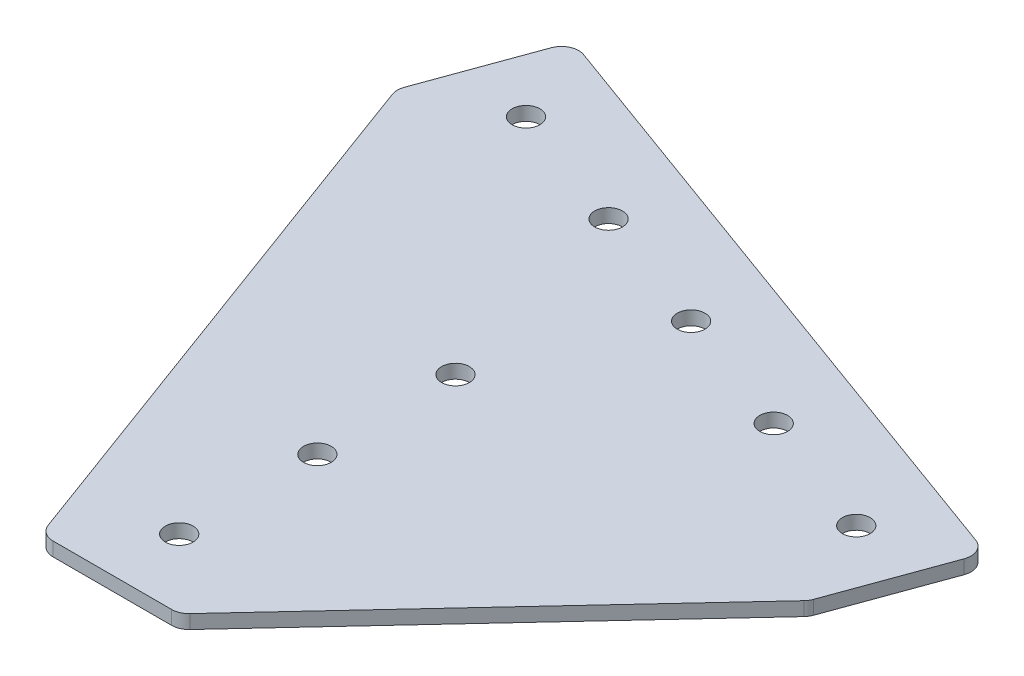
ISO-10303-21;
HEADER;
FILE_DESCRIPTION(('STEP AP214'),'2;1');
FILE_NAME('part.step','',(''),(''),'','','');
FILE_SCHEMA(('AUTOMOTIVE_DESIGN { 1 0 10303 214 1 1 1 1 }'));
ENDSEC;
DATA;
#1=APPLICATION_CONTEXT('core data for automotive mechanical design processes');
#2=APPLICATION_PROTOCOL_DEFINITION('international standard','automotive_design',2000,#1);
#3=PRODUCT_CONTEXT('',#1,'mechanical');
#4=PRODUCT('Part','Part','',(#3));
#5=PRODUCT_RELATED_PRODUCT_CATEGORY('part','',(#4));
#6=PRODUCT_DEFINITION_FORMATION('','',#4);
#7=PRODUCT_DEFINITION_CONTEXT('part definition',#1,'design');
#8=PRODUCT_DEFINITION('design','',#6,#7);
#9=PRODUCT_DEFINITION_SHAPE('','',#8);
#10=(LENGTH_UNIT() NAMED_UNIT(*) SI_UNIT(.MILLI.,.METRE.));
#11=(NAMED_UNIT(*) PLANE_ANGLE_UNIT() SI_UNIT($,.RADIAN.));
#12=(NAMED_UNIT(*) SI_UNIT($,.STERADIAN.) SOLID_ANGLE_UNIT());
#13=UNCERTAINTY_MEASURE_WITH_UNIT(LENGTH_MEASURE(1.E-05),#10,'distance_accuracy_value','');
#14=(GEOMETRIC_REPRESENTATION_CONTEXT(3) GLOBAL_UNCERTAINTY_ASSIGNED_CONTEXT((#13)) GLOBAL_UNIT_ASSIGNED_CONTEXT((#10,
#11,#12)) REPRESENTATION_CONTEXT('',''));
#15=CARTESIAN_POINT('',(0.,0.,0.));
#16=DIRECTION('',(0.,0.,1.));
#17=DIRECTION('',(1.,0.,0.));
#18=AXIS2_PLACEMENT_3D('',#15,#16,#17);
#19=CARTESIAN_POINT('',(25.4,2.54,0.));
#20=DIRECTION('',(0.,0.,-1.));
#21=DIRECTION('',(-1.,0.,0.));
#22=AXIS2_PLACEMENT_3D('',#19,#20,#21);
#23=PLANE('',#22);
#24=DIRECTION('',(1.,0.,0.));
#25=VECTOR('',#24,1.);
#26=CARTESIAN_POINT('',(25.4,2.54,0.));
#27=LINE('',#26,#25);
#28=CARTESIAN_POINT('',(2.21311904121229,2.54,0.));
#29=VERTEX_POINT('',#28);
#30=CARTESIAN_POINT('',(24.0165025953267,2.54,0.));
#31=VERTEX_POINT('',#30);
#32=EDGE_CURVE('E158',#29,#31,#27,.T.);
#33=ORIENTED_EDGE('',*,*,#32,.F.);
#34=DIRECTION('',(0.,-1.,0.));
#35=VECTOR('',#34,1.);
#36=CARTESIAN_POINT('',(2.21311904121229,2.54,0.));
#37=LINE('',#36,#35);
#38=CARTESIAN_POINT('',(2.21311904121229,0.,0.));
#39=VERTEX_POINT('',#38);
#40=EDGE_CURVE('E216',#29,#39,#37,.T.);
#41=ORIENTED_EDGE('',*,*,#40,.T.);
#42=DIRECTION('',(1.,0.,0.));
#43=VECTOR('',#42,1.);
#44=CARTESIAN_POINT('',(25.4,0.,0.));
#45=LINE('',#44,#43);
#46=CARTESIAN_POINT('',(24.0165025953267,0.,0.));
#47=VERTEX_POINT('',#46);
#48=EDGE_CURVE('E257',#39,#47,#45,.T.);
#49=ORIENTED_EDGE('',*,*,#48,.T.);
#50=DIRECTION('',(0.,-1.,0.));
#51=VECTOR('',#50,1.);
#52=CARTESIAN_POINT('',(24.0165025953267,2.54,0.));
#53=LINE('',#52,#51);
#54=EDGE_CURVE('E213',#47,#31,#53,.F.);
#55=ORIENTED_EDGE('',*,*,#54,.T.);
#56=EDGE_LOOP('',(#33,#41,#49,#55));
#57=FACE_BOUND('',#56,.T.);
#58=ADVANCED_FACE('F36',(#57),#23,.F.);
#59=CARTESIAN_POINT('',(81.1889283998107,2.54,-60.0151561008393));
#60=DIRECTION('',(-0.732424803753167,0.,-0.680847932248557));
#61=DIRECTION('',(-0.680847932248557,0.,0.732424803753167));
#62=AXIS2_PLACEMENT_3D('',#59,#60,#61);
#63=PLANE('',#62);
#64=DIRECTION('',(0.680847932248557,0.,-0.732424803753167));
#65=VECTOR('',#64,1.);
#66=CARTESIAN_POINT('',(81.1889283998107,2.54,-60.0151561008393));
#67=LINE('',#66,#65);
#68=CARTESIAN_POINT('',(26.341951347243,2.54,-1.01330781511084));
#69=VERTEX_POINT('',#68);
#70=CARTESIAN_POINT('',(80.7508961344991,2.54,-59.5439411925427));
#71=VERTEX_POINT('',#70);
#72=EDGE_CURVE('E165',#69,#71,#67,.T.);
#73=ORIENTED_EDGE('',*,*,#72,.F.);
#74=DIRECTION('',(0.,-1.,0.));
#75=VECTOR('',#74,1.);
#76=CARTESIAN_POINT('',(26.3419513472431,2.54,-1.01330781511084));
#77=LINE('',#76,#75);
#78=CARTESIAN_POINT('',(26.341951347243,0.,-1.01330781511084));
#79=VERTEX_POINT('',#78);
#80=EDGE_CURVE('E223',#69,#79,#77,.T.);
#81=ORIENTED_EDGE('',*,*,#80,.T.);
#82=DIRECTION('',(0.680847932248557,0.,-0.732424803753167));
#83=VECTOR('',#82,1.);
#84=CARTESIAN_POINT('',(81.1889283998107,0.,-60.0151561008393));
#85=LINE('',#84,#83);
#86=CARTESIAN_POINT('',(80.7508961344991,0.,-59.5439411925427));
#87=VERTEX_POINT('',#86);
#88=EDGE_CURVE('E251',#79,#87,#85,.T.);
#89=ORIENTED_EDGE('',*,*,#88,.T.);
#90=DIRECTION('',(0.,-1.,0.));
#91=VECTOR('',#90,1.);
#92=CARTESIAN_POINT('',(80.7508961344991,2.54,-59.5439411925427));
#93=LINE('',#92,#91);
#94=EDGE_CURVE('E220',#87,#71,#93,.F.);
#95=ORIENTED_EDGE('',*,*,#94,.T.);
#96=EDGE_LOOP('',(#73,#81,#89,#95));
#97=FACE_BOUND('',#96,.T.);
#98=ADVANCED_FACE('F369',(#97),#63,.F.);
#99=CARTESIAN_POINT('',(89.8762400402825,2.54,-83.8833486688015));
#100=DIRECTION('',(-0.939692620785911,0.,-0.342020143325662));
#101=DIRECTION('',(-0.342020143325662,0.,0.939692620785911));
#102=AXIS2_PLACEMENT_3D('',#99,#100,#101);
#103=PLANE('',#102);
#104=DIRECTION('',(0.342020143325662,0.,-0.939692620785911));
#105=VECTOR('',#104,1.);
#106=CARTESIAN_POINT('',(89.8762400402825,2.54,-83.8833486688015));
#107=LINE('',#106,#105);
#108=CARTESIAN_POINT('',(81.408971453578,2.54,-60.6197194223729));
#109=VERTEX_POINT('',#108);
#110=CARTESIAN_POINT('',(88.7903260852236,2.54,-80.8998245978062));
#111=VERTEX_POINT('',#110);
#112=EDGE_CURVE('E233',#109,#111,#107,.T.);
#113=ORIENTED_EDGE('',*,*,#112,.F.);
#114=DIRECTION('',(0.,-1.,0.));
#115=VECTOR('',#114,1.);
#116=CARTESIAN_POINT('',(81.408971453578,2.54,-60.6197194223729));
#117=LINE('',#116,#115);
#118=CARTESIAN_POINT('',(81.408971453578,0.,-60.6197194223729));
#119=VERTEX_POINT('',#118);
#120=EDGE_CURVE('E11',#109,#119,#117,.T.);
#121=ORIENTED_EDGE('',*,*,#120,.T.);
#122=DIRECTION('',(0.342020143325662,0.,-0.939692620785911));
#123=VECTOR('',#122,1.);
#124=CARTESIAN_POINT('',(89.8762400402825,0.,-83.8833486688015));
#125=LINE('',#124,#123);
#126=CARTESIAN_POINT('',(88.7903260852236,0.,-80.8998245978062));
#127=VERTEX_POINT('',#126);
#128=EDGE_CURVE('E236',#119,#127,#125,.T.);
#129=ORIENTED_EDGE('',*,*,#128,.T.);
#130=DIRECTION('',(0.,-1.,0.));
#131=VECTOR('',#130,1.);
#132=CARTESIAN_POINT('',(88.7903260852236,2.54,-80.8998245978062));
#133=LINE('',#132,#131);
#134=EDGE_CURVE('E45',#127,#111,#133,.F.);
#135=ORIENTED_EDGE('',*,*,#134,.T.);
#136=EDGE_LOOP('',(#113,#121,#129,#135));
#137=FACE_BOUND('',#136,.T.);
#138=ADVANCED_FACE('F232',(#137),#103,.F.);
#139=CARTESIAN_POINT('',(-29.4647227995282,2.54,-127.319906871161));
#140=DIRECTION('',(-0.342020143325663,0.,0.939692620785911));
#141=DIRECTION('',(0.939692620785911,0.,0.342020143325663));
#142=AXIS2_PLACEMENT_3D('',#139,#140,#141);
#143=PLANE('',#142);
#144=DIRECTION('',(-0.93969262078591,0.,-0.342020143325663));
#145=VECTOR('',#144,1.);
#146=CARTESIAN_POINT('',(-29.4647227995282,0.,-127.319906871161));
#147=LINE('',#146,#145);
#148=CARTESIAN_POINT('',(86.8927159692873,0.,-84.9692626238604));
#149=VERTEX_POINT('',#148);
#150=CARTESIAN_POINT('',(-26.4811987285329,0.,-126.233992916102));
#151=VERTEX_POINT('',#150);
#152=EDGE_CURVE('E167',#149,#151,#147,.T.);
#153=ORIENTED_EDGE('',*,*,#152,.T.);
#154=DIRECTION('',(0.,-1.,0.));
#155=VECTOR('',#154,1.);
#156=CARTESIAN_POINT('',(-26.4811987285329,2.54,-126.233992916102));
#157=LINE('',#156,#155);
#158=CARTESIAN_POINT('',(-26.4811987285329,2.54,-126.233992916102));
#159=VERTEX_POINT('',#158);
#160=EDGE_CURVE('E52',#151,#159,#157,.F.);
#161=ORIENTED_EDGE('',*,*,#160,.T.);
#162=DIRECTION('',(-0.93969262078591,0.,-0.342020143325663));
#163=VECTOR('',#162,1.);
#164=CARTESIAN_POINT('',(-29.4647227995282,2.54,-127.319906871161));
#165=LINE('',#164,#163);
#166=CARTESIAN_POINT('',(86.8927159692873,2.54,-84.9692626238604));
#167=VERTEX_POINT('',#166);
#168=EDGE_CURVE('E243',#167,#159,#165,.T.);
#169=ORIENTED_EDGE('',*,*,#168,.F.);
#170=DIRECTION('',(0.,-1.,0.));
#171=VECTOR('',#170,1.);
#172=CARTESIAN_POINT('',(86.8927159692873,2.54,-84.9692626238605));
#173=LINE('',#172,#171);
#174=EDGE_CURVE('E207',#167,#149,#173,.T.);
#175=ORIENTED_EDGE('',*,*,#174,.T.);
#176=EDGE_LOOP('',(#153,#161,#169,#175));
#177=FACE_BOUND('',#176,.T.);
#178=ADVANCED_FACE('F247',(#177),#143,.F.);
#179=CARTESIAN_POINT('',(-38.15203444,2.54,-103.451714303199));
#180=DIRECTION('',(0.939692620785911,0.,0.342020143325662));
#181=DIRECTION('',(0.342020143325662,0.,-0.939692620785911));
#182=AXIS2_PLACEMENT_3D('',#179,#180,#181);
#183=PLANE('',#182);
#184=DIRECTION('',(-0.342020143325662,0.,0.939692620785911));
#185=VECTOR('',#184,1.);
#186=CARTESIAN_POINT('',(-38.15203444,0.,-103.451714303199));
#187=LINE('',#186,#185);
#188=CARTESIAN_POINT('',(-30.5506367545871,0.,-124.336382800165));
#189=VERTEX_POINT('',#188);
#190=CARTESIAN_POINT('',(-37.7541787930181,0.,-104.544813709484));
#191=VERTEX_POINT('',#190);
#192=EDGE_CURVE('E159',#189,#191,#187,.T.);
#193=ORIENTED_EDGE('',*,*,#192,.T.);
#194=DIRECTION('',(0.,-1.,0.));
#195=VECTOR('',#194,1.);
#196=CARTESIAN_POINT('',(-37.7541787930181,2.54,-104.544813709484));
#197=LINE('',#196,#195);
#198=CARTESIAN_POINT('',(-37.7541787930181,2.54,-104.544813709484));
#199=VERTEX_POINT('',#198);
#200=EDGE_CURVE('E133',#191,#199,#197,.F.);
#201=ORIENTED_EDGE('',*,*,#200,.T.);
#202=DIRECTION('',(-0.342020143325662,0.,0.939692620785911));
#203=VECTOR('',#202,1.);
#204=CARTESIAN_POINT('',(-38.15203444,2.54,-103.451714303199));
#205=LINE('',#204,#203);
#206=CARTESIAN_POINT('',(-30.5506367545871,2.54,-124.336382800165));
#207=VERTEX_POINT('',#206);
#208=EDGE_CURVE('E264',#207,#199,#205,.T.);
#209=ORIENTED_EDGE('',*,*,#208,.F.);
#210=DIRECTION('',(0.,-1.,0.));
#211=VECTOR('',#210,1.);
#212=CARTESIAN_POINT('',(-30.5506367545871,2.54,-124.336382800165));
#213=LINE('',#212,#211);
#214=EDGE_CURVE('E139',#207,#189,#213,.T.);
#215=ORIENTED_EDGE('',*,*,#214,.T.);
#216=EDGE_LOOP('',(#193,#201,#209,#215));
#217=FACE_BOUND('',#216,.T.);
#218=ADVANCED_FACE('F411',(#217),#183,.F.);
#219=CARTESIAN_POINT('',(0.,2.54,0.));
#220=DIRECTION('',(0.938230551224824,0.,-0.34601074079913));
#221=DIRECTION('',(-0.34601074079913,0.,-0.938230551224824));
#222=AXIS2_PLACEMENT_3D('',#219,#220,#221);
#223=PLANE('',#222);
#224=DIRECTION('',(0.34601074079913,0.,0.938230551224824));
#225=VECTOR('',#224,1.);
#226=CARTESIAN_POINT('',(0.,2.54,0.));
#227=LINE('',#226,#225);
#228=CARTESIAN_POINT('',(-37.7495367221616,2.54,-102.360315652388));
#229=VERTEX_POINT('',#228);
#230=CARTESIAN_POINT('',(-0.765762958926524,2.54,-2.07641589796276));
#231=VERTEX_POINT('',#230);
#232=EDGE_CURVE('E149',#229,#231,#227,.T.);
#233=ORIENTED_EDGE('',*,*,#232,.F.);
#234=DIRECTION('',(0.,-1.,0.));
#235=VECTOR('',#234,1.);
#236=CARTESIAN_POINT('',(-37.7495367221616,2.54,-102.360315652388));
#237=LINE('',#236,#235);
#238=CARTESIAN_POINT('',(-37.7495367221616,0.,-102.360315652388));
#239=VERTEX_POINT('',#238);
#240=EDGE_CURVE('E132',#229,#239,#237,.T.);
#241=ORIENTED_EDGE('',*,*,#240,.T.);
#242=DIRECTION('',(0.34601074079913,0.,0.938230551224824));
#243=VECTOR('',#242,1.);
#244=CARTESIAN_POINT('',(0.,0.,0.));
#245=LINE('',#244,#243);
#246=CARTESIAN_POINT('',(-0.765762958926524,0.,-2.07641589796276));
#247=VERTEX_POINT('',#246);
#248=EDGE_CURVE('E146',#239,#247,#245,.T.);
#249=ORIENTED_EDGE('',*,*,#248,.T.);
#250=DIRECTION('',(0.,-1.,0.));
#251=VECTOR('',#250,1.);
#252=CARTESIAN_POINT('',(-0.765762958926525,2.54,-2.07641589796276));
#253=LINE('',#252,#251);
#254=EDGE_CURVE('E152',#247,#231,#253,.F.);
#255=ORIENTED_EDGE('',*,*,#254,.T.);
#256=EDGE_LOOP('',(#233,#241,#249,#255));
#257=FACE_BOUND('',#256,.T.);
#258=ADVANCED_FACE('F145',(#257),#223,.F.);
#259=CARTESIAN_POINT('',(0.,2.54,0.));
#260=DIRECTION('',(0.,-1.,0.));
#261=DIRECTION('',(0.,0.,-1.));
#262=AXIS2_PLACEMENT_3D('',#259,#260,#261);
#263=PLANE('',#262);
#264=CARTESIAN_POINT('',(73.5984879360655,2.54,-76.2929082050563));
#265=DIRECTION('',(0.,-1.,0.));
#266=DIRECTION('',(0.,0.,-1.));
#267=AXIS2_PLACEMENT_3D('',#264,#265,#266);
#268=CIRCLE('',#267,2.55270000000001);
#269=CARTESIAN_POINT('',(73.5984879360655,2.54,-78.8456082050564));
#270=VERTEX_POINT('',#269);
#271=EDGE_CURVE('E326',#270,#270,#268,.T.);
#272=ORIENTED_EDGE('',*,*,#271,.T.);
#273=EDGE_LOOP('',(#272));
#274=FACE_BOUND('',#273,.T.);
#275=CARTESIAN_POINT('',(49.7302953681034,2.54,-84.9802198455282));
#276=DIRECTION('',(0.,-1.,0.));
#277=DIRECTION('',(0.,0.,-1.));
#278=AXIS2_PLACEMENT_3D('',#275,#276,#277);
#279=CIRCLE('',#278,2.5527);
#280=CARTESIAN_POINT('',(49.7302953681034,2.54,-87.5329198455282));
#281=VERTEX_POINT('',#280);
#282=EDGE_CURVE('E318',#281,#281,#279,.T.);
#283=ORIENTED_EDGE('',*,*,#282,.T.);
#284=EDGE_LOOP('',(#283));
#285=FACE_BOUND('',#284,.T.);
#286=CARTESIAN_POINT('',(25.8621028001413,2.54,-93.667531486));
#287=DIRECTION('',(0.,-1.,0.));
#288=DIRECTION('',(0.,0.,-1.));
#289=AXIS2_PLACEMENT_3D('',#286,#287,#288);
#290=CIRCLE('',#289,2.5527);
#291=CARTESIAN_POINT('',(25.8621028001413,2.54,-96.220231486));
#292=VERTEX_POINT('',#291);
#293=EDGE_CURVE('E310',#292,#292,#290,.T.);
#294=ORIENTED_EDGE('',*,*,#293,.T.);
#295=EDGE_LOOP('',(#294));
#296=FACE_BOUND('',#295,.T.);
#297=CARTESIAN_POINT('',(1.99391023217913,2.54,-102.354843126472));
#298=DIRECTION('',(0.,-1.,0.));
#299=DIRECTION('',(0.,0.,-1.));
#300=AXIS2_PLACEMENT_3D('',#297,#298,#299);
#301=CIRCLE('',#300,2.5527);
#302=CARTESIAN_POINT('',(1.99391023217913,2.54,-104.907543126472));
#303=VERTEX_POINT('',#302);
#304=EDGE_CURVE('E302',#303,#303,#301,.T.);
#305=ORIENTED_EDGE('',*,*,#304,.T.);
#306=EDGE_LOOP('',(#305));
#307=FACE_BOUND('',#306,.T.);
#308=CARTESIAN_POINT('',(-21.874282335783,2.54,-111.042154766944));
#309=DIRECTION('',(0.,-1.,0.));
#310=DIRECTION('',(0.,0.,-1.));
#311=AXIS2_PLACEMENT_3D('',#308,#309,#310);
#312=CIRCLE('',#311,2.5527);
#313=CARTESIAN_POINT('',(-21.874282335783,2.54,-113.594854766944));
#314=VERTEX_POINT('',#313);
#315=EDGE_CURVE('E294',#314,#314,#312,.T.);
#316=ORIENTED_EDGE('',*,*,#315,.T.);
#317=EDGE_LOOP('',(#316));
#318=FACE_BOUND('',#317,.T.);
#319=CARTESIAN_POINT('',(12.7,2.54,-63.5));
#320=DIRECTION('',(0.,-1.,0.));
#321=DIRECTION('',(0.,0.,-1.));
#322=AXIS2_PLACEMENT_3D('',#319,#320,#321);
#323=CIRCLE('',#322,2.5527);
#324=CARTESIAN_POINT('',(12.7,2.54,-66.0527));
#325=VERTEX_POINT('',#324);
#326=EDGE_CURVE('E286',#325,#325,#323,.T.);
#327=ORIENTED_EDGE('',*,*,#326,.T.);
#328=EDGE_LOOP('',(#327));
#329=FACE_BOUND('',#328,.T.);
#330=CARTESIAN_POINT('',(12.7,2.54,-38.1));
#331=DIRECTION('',(0.,-1.,0.));
#332=DIRECTION('',(0.,0.,-1.));
#333=AXIS2_PLACEMENT_3D('',#330,#331,#332);
#334=CIRCLE('',#333,2.5527);
#335=CARTESIAN_POINT('',(12.7,2.54,-40.6527));
#336=VERTEX_POINT('',#335);
#337=EDGE_CURVE('E278',#336,#336,#334,.T.);
#338=ORIENTED_EDGE('',*,*,#337,.T.);
#339=EDGE_LOOP('',(#338));
#340=FACE_BOUND('',#339,.T.);
#341=CARTESIAN_POINT('',(12.7,2.54,-12.7));
#342=DIRECTION('',(0.,-1.,0.));
#343=DIRECTION('',(0.,0.,-1.));
#344=AXIS2_PLACEMENT_3D('',#341,#342,#343);
#345=CIRCLE('',#344,2.5527);
#346=CARTESIAN_POINT('',(12.7,2.54,-15.2527));
#347=VERTEX_POINT('',#346);
#348=EDGE_CURVE('E261',#347,#347,#345,.T.);
#349=ORIENTED_EDGE('',*,*,#348,.T.);
#350=EDGE_LOOP('',(#349));
#351=FACE_BOUND('',#350,.T.);
#352=ORIENTED_EDGE('',*,*,#208,.T.);
#353=CARTESIAN_POINT('',(-34.7706547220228,2.54,-103.458899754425));
#354=DIRECTION('',(0.,-1.,0.));
#355=DIRECTION('',(0.,0.,-1.));
#356=AXIS2_PLACEMENT_3D('',#353,#354,#355);
#357=CIRCLE('',#356,3.175);
#358=EDGE_CURVE('E204',#199,#229,#357,.F.);
#359=ORIENTED_EDGE('',*,*,#358,.T.);
#360=ORIENTED_EDGE('',*,*,#232,.T.);
#361=CARTESIAN_POINT('',(2.21311904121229,2.54,-3.175));
#362=DIRECTION('',(0.,-1.,0.));
#363=DIRECTION('',(0.,0.,-1.));
#364=AXIS2_PLACEMENT_3D('',#361,#362,#363);
#365=CIRCLE('',#364,3.175);
#366=EDGE_CURVE('E198',#231,#29,#365,.F.);
#367=ORIENTED_EDGE('',*,*,#366,.T.);
#368=ORIENTED_EDGE('',*,*,#32,.T.);
#369=CARTESIAN_POINT('',(24.0165025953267,2.54,-3.175));
#370=DIRECTION('',(0.,-1.,0.));
#371=DIRECTION('',(0.,0.,-1.));
#372=AXIS2_PLACEMENT_3D('',#369,#370,#371);
#373=CIRCLE('',#372,3.175);
#374=EDGE_CURVE('E195',#31,#69,#373,.F.);
#375=ORIENTED_EDGE('',*,*,#374,.T.);
#376=ORIENTED_EDGE('',*,*,#72,.T.);
#377=CARTESIAN_POINT('',(78.4254473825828,2.54,-61.7056333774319));
#378=DIRECTION('',(0.,-1.,0.));
#379=DIRECTION('',(0.,0.,-1.));
#380=AXIS2_PLACEMENT_3D('',#377,#378,#379);
#381=CIRCLE('',#380,3.175);
#382=EDGE_CURVE('E192',#71,#109,#381,.F.);
#383=ORIENTED_EDGE('',*,*,#382,.T.);
#384=ORIENTED_EDGE('',*,*,#112,.T.);
#385=CARTESIAN_POINT('',(85.8068020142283,2.54,-81.9857385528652));
#386=DIRECTION('',(0.,-1.,0.));
#387=DIRECTION('',(0.,0.,-1.));
#388=AXIS2_PLACEMENT_3D('',#385,#386,#387);
#389=CIRCLE('',#388,3.175);
#390=EDGE_CURVE('E59',#111,#167,#389,.F.);
#391=ORIENTED_EDGE('',*,*,#390,.T.);
#392=ORIENTED_EDGE('',*,*,#168,.T.);
#393=CARTESIAN_POINT('',(-27.5671126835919,2.54,-123.250468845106));
#394=DIRECTION('',(0.,-1.,0.));
#395=DIRECTION('',(0.,0.,-1.));
#396=AXIS2_PLACEMENT_3D('',#393,#394,#395);
#397=CIRCLE('',#396,3.175);
#398=EDGE_CURVE('E201',#159,#207,#397,.F.);
#399=ORIENTED_EDGE('',*,*,#398,.T.);
#400=EDGE_LOOP('',(#352,#359,#360,#367,#368,#375,#376,#383,#384,#391,#392,#399));
#401=FACE_BOUND('',#400,.T.);
#402=ADVANCED_FACE('F239',(#274,#285,#296,#307,#318,#329,#340,#351,#401),#263,.F.);
#403=CARTESIAN_POINT('',(0.,0.,0.));
#404=DIRECTION('',(0.,-1.,0.));
#405=DIRECTION('',(0.,0.,-1.));
#406=AXIS2_PLACEMENT_3D('',#403,#404,#405);
#407=PLANE('',#406);
#408=CARTESIAN_POINT('',(73.5984879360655,0.,-76.2929082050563));
#409=DIRECTION('',(0.,-1.,0.));
#410=DIRECTION('',(0.,0.,-1.));
#411=AXIS2_PLACEMENT_3D('',#408,#409,#410);
#412=CIRCLE('',#411,2.55269999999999);
#413=CARTESIAN_POINT('',(73.5984879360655,0.,-78.8456082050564));
#414=VERTEX_POINT('',#413);
#415=EDGE_CURVE('E330',#414,#414,#412,.T.);
#416=ORIENTED_EDGE('',*,*,#415,.F.);
#417=EDGE_LOOP('',(#416));
#418=FACE_BOUND('',#417,.T.);
#419=CARTESIAN_POINT('',(49.7302953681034,0.,-84.9802198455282));
#420=DIRECTION('',(0.,-1.,0.));
#421=DIRECTION('',(0.,0.,-1.));
#422=AXIS2_PLACEMENT_3D('',#419,#420,#421);
#423=CIRCLE('',#422,2.55269999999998);
#424=CARTESIAN_POINT('',(49.7302953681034,0.,-87.5329198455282));
#425=VERTEX_POINT('',#424);
#426=EDGE_CURVE('E322',#425,#425,#423,.T.);
#427=ORIENTED_EDGE('',*,*,#426,.F.);
#428=EDGE_LOOP('',(#427));
#429=FACE_BOUND('',#428,.T.);
#430=CARTESIAN_POINT('',(25.8621028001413,0.,-93.667531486));
#431=DIRECTION('',(0.,-1.,0.));
#432=DIRECTION('',(0.,0.,-1.));
#433=AXIS2_PLACEMENT_3D('',#430,#431,#432);
#434=CIRCLE('',#433,2.55269999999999);
#435=CARTESIAN_POINT('',(25.8621028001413,0.,-96.220231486));
#436=VERTEX_POINT('',#435);
#437=EDGE_CURVE('E314',#436,#436,#434,.T.);
#438=ORIENTED_EDGE('',*,*,#437,.F.);
#439=EDGE_LOOP('',(#438));
#440=FACE_BOUND('',#439,.T.);
#441=CARTESIAN_POINT('',(1.99391023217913,0.,-102.354843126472));
#442=DIRECTION('',(0.,-1.,0.));
#443=DIRECTION('',(0.,0.,-1.));
#444=AXIS2_PLACEMENT_3D('',#441,#442,#443);
#445=CIRCLE('',#444,2.55269999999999);
#446=CARTESIAN_POINT('',(1.99391023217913,0.,-104.907543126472));
#447=VERTEX_POINT('',#446);
#448=EDGE_CURVE('E306',#447,#447,#445,.T.);
#449=ORIENTED_EDGE('',*,*,#448,.F.);
#450=EDGE_LOOP('',(#449));
#451=FACE_BOUND('',#450,.T.);
#452=CARTESIAN_POINT('',(-21.874282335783,0.,-111.042154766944));
#453=DIRECTION('',(0.,-1.,0.));
#454=DIRECTION('',(0.,0.,-1.));
#455=AXIS2_PLACEMENT_3D('',#452,#453,#454);
#456=CIRCLE('',#455,2.55269999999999);
#457=CARTESIAN_POINT('',(-21.874282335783,0.,-113.594854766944));
#458=VERTEX_POINT('',#457);
#459=EDGE_CURVE('E298',#458,#458,#456,.T.);
#460=ORIENTED_EDGE('',*,*,#459,.F.);
#461=EDGE_LOOP('',(#460));
#462=FACE_BOUND('',#461,.T.);
#463=CARTESIAN_POINT('',(12.7,0.,-63.5));
#464=DIRECTION('',(0.,-1.,0.));
#465=DIRECTION('',(0.,0.,-1.));
#466=AXIS2_PLACEMENT_3D('',#463,#464,#465);
#467=CIRCLE('',#466,2.55269999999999);
#468=CARTESIAN_POINT('',(12.7,0.,-66.0527));
#469=VERTEX_POINT('',#468);
#470=EDGE_CURVE('E290',#469,#469,#467,.T.);
#471=ORIENTED_EDGE('',*,*,#470,.F.);
#472=EDGE_LOOP('',(#471));
#473=FACE_BOUND('',#472,.T.);
#474=CARTESIAN_POINT('',(12.7,0.,-38.1));
#475=DIRECTION('',(0.,-1.,0.));
#476=DIRECTION('',(0.,0.,-1.));
#477=AXIS2_PLACEMENT_3D('',#474,#475,#476);
#478=CIRCLE('',#477,2.55269999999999);
#479=CARTESIAN_POINT('',(12.7,0.,-40.6527));
#480=VERTEX_POINT('',#479);
#481=EDGE_CURVE('E282',#480,#480,#478,.T.);
#482=ORIENTED_EDGE('',*,*,#481,.F.);
#483=EDGE_LOOP('',(#482));
#484=FACE_BOUND('',#483,.T.);
#485=CARTESIAN_POINT('',(12.7,0.,-12.7));
#486=DIRECTION('',(0.,-1.,0.));
#487=DIRECTION('',(0.,0.,-1.));
#488=AXIS2_PLACEMENT_3D('',#485,#486,#487);
#489=CIRCLE('',#488,2.55269999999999);
#490=CARTESIAN_POINT('',(12.7,0.,-15.2527));
#491=VERTEX_POINT('',#490);
#492=EDGE_CURVE('E274',#491,#491,#489,.T.);
#493=ORIENTED_EDGE('',*,*,#492,.F.);
#494=EDGE_LOOP('',(#493));
#495=FACE_BOUND('',#494,.T.);
#496=ORIENTED_EDGE('',*,*,#248,.F.);
#497=CARTESIAN_POINT('',(-34.7706547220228,0.,-103.458899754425));
#498=DIRECTION('',(0.,-1.,0.));
#499=DIRECTION('',(0.,0.,-1.));
#500=AXIS2_PLACEMENT_3D('',#497,#498,#499);
#501=CIRCLE('',#500,3.175);
#502=EDGE_CURVE('E128',#239,#191,#501,.T.);
#503=ORIENTED_EDGE('',*,*,#502,.T.);
#504=ORIENTED_EDGE('',*,*,#192,.F.);
#505=CARTESIAN_POINT('',(-27.5671126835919,0.,-123.250468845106));
#506=DIRECTION('',(0.,-1.,0.));
#507=DIRECTION('',(0.,0.,-1.));
#508=AXIS2_PLACEMENT_3D('',#505,#506,#507);
#509=CIRCLE('',#508,3.175);
#510=EDGE_CURVE('E140',#189,#151,#509,.T.);
#511=ORIENTED_EDGE('',*,*,#510,.T.);
#512=ORIENTED_EDGE('',*,*,#152,.F.);
#513=CARTESIAN_POINT('',(85.8068020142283,0.,-81.9857385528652));
#514=DIRECTION('',(0.,-1.,0.));
#515=DIRECTION('',(0.,0.,-1.));
#516=AXIS2_PLACEMENT_3D('',#513,#514,#515);
#517=CIRCLE('',#516,3.175);
#518=EDGE_CURVE('E151',#149,#127,#517,.T.);
#519=ORIENTED_EDGE('',*,*,#518,.T.);
#520=ORIENTED_EDGE('',*,*,#128,.F.);
#521=CARTESIAN_POINT('',(78.4254473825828,0.,-61.7056333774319));
#522=DIRECTION('',(0.,-1.,0.));
#523=DIRECTION('',(0.,0.,-1.));
#524=AXIS2_PLACEMENT_3D('',#521,#522,#523);
#525=CIRCLE('',#524,3.175);
#526=EDGE_CURVE('E175',#119,#87,#525,.T.);
#527=ORIENTED_EDGE('',*,*,#526,.T.);
#528=ORIENTED_EDGE('',*,*,#88,.F.);
#529=CARTESIAN_POINT('',(24.0165025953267,0.,-3.175));
#530=DIRECTION('',(0.,-1.,0.));
#531=DIRECTION('',(0.,0.,-1.));
#532=AXIS2_PLACEMENT_3D('',#529,#530,#531);
#533=CIRCLE('',#532,3.175);
#534=EDGE_CURVE('E178',#79,#47,#533,.T.);
#535=ORIENTED_EDGE('',*,*,#534,.T.);
#536=ORIENTED_EDGE('',*,*,#48,.F.);
#537=CARTESIAN_POINT('',(2.21311904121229,0.,-3.175));
#538=DIRECTION('',(0.,-1.,0.));
#539=DIRECTION('',(0.,0.,-1.));
#540=AXIS2_PLACEMENT_3D('',#537,#538,#539);
#541=CIRCLE('',#540,3.175);
#542=EDGE_CURVE('E156',#39,#247,#541,.T.);
#543=ORIENTED_EDGE('',*,*,#542,.T.);
#544=EDGE_LOOP('',(#496,#503,#504,#511,#512,#519,#520,#527,#528,#535,#536,#543));
#545=FACE_BOUND('',#544,.T.);
#546=ADVANCED_FACE('F154',(#418,#429,#440,#451,#462,#473,#484,#495,#545),#407,.T.);
#547=CARTESIAN_POINT('',(12.7,0.,-12.7));
#548=DIRECTION('',(0.,-1.,0.));
#549=DIRECTION('',(0.,0.,-1.));
#550=AXIS2_PLACEMENT_3D('',#547,#548,#549);
#551=CYLINDRICAL_SURFACE('',#550,2.55269999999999);
#552=ORIENTED_EDGE('',*,*,#348,.F.);
#553=EDGE_LOOP('',(#552));
#554=FACE_BOUND('',#553,.T.);
#555=ORIENTED_EDGE('',*,*,#492,.T.);
#556=EDGE_LOOP('',(#555));
#557=FACE_BOUND('',#556,.T.);
#558=ADVANCED_FACE('F340',(#554,#557),#551,.F.);
#559=CARTESIAN_POINT('',(12.7,0.,-38.1));
#560=DIRECTION('',(0.,-1.,0.));
#561=DIRECTION('',(0.,0.,-1.));
#562=AXIS2_PLACEMENT_3D('',#559,#560,#561);
#563=CYLINDRICAL_SURFACE('',#562,2.55269999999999);
#564=ORIENTED_EDGE('',*,*,#337,.F.);
#565=EDGE_LOOP('',(#564));
#566=FACE_BOUND('',#565,.T.);
#567=ORIENTED_EDGE('',*,*,#481,.T.);
#568=EDGE_LOOP('',(#567));
#569=FACE_BOUND('',#568,.T.);
#570=ADVANCED_FACE('F357',(#566,#569),#563,.F.);
#571=CARTESIAN_POINT('',(12.7,0.,-63.5));
#572=DIRECTION('',(0.,-1.,0.));
#573=DIRECTION('',(0.,0.,-1.));
#574=AXIS2_PLACEMENT_3D('',#571,#572,#573);
#575=CYLINDRICAL_SURFACE('',#574,2.55269999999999);
#576=ORIENTED_EDGE('',*,*,#326,.F.);
#577=EDGE_LOOP('',(#576));
#578=FACE_BOUND('',#577,.T.);
#579=ORIENTED_EDGE('',*,*,#470,.T.);
#580=EDGE_LOOP('',(#579));
#581=FACE_BOUND('',#580,.T.);
#582=ADVANCED_FACE('F363',(#578,#581),#575,.F.);
#583=CARTESIAN_POINT('',(-21.874282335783,0.,-111.042154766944));
#584=DIRECTION('',(0.,-1.,0.));
#585=DIRECTION('',(0.,0.,-1.));
#586=AXIS2_PLACEMENT_3D('',#583,#584,#585);
#587=CYLINDRICAL_SURFACE('',#586,2.55269999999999);
#588=ORIENTED_EDGE('',*,*,#315,.F.);
#589=EDGE_LOOP('',(#588));
#590=FACE_BOUND('',#589,.T.);
#591=ORIENTED_EDGE('',*,*,#459,.T.);
#592=EDGE_LOOP('',(#591));
#593=FACE_BOUND('',#592,.T.);
#594=ADVANCED_FACE('F473',(#590,#593),#587,.F.);
#595=CARTESIAN_POINT('',(1.99391023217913,0.,-102.354843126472));
#596=DIRECTION('',(0.,-1.,0.));
#597=DIRECTION('',(0.,0.,-1.));
#598=AXIS2_PLACEMENT_3D('',#595,#596,#597);
#599=CYLINDRICAL_SURFACE('',#598,2.55269999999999);
#600=ORIENTED_EDGE('',*,*,#304,.F.);
#601=EDGE_LOOP('',(#600));
#602=FACE_BOUND('',#601,.T.);
#603=ORIENTED_EDGE('',*,*,#448,.T.);
#604=EDGE_LOOP('',(#603));
#605=FACE_BOUND('',#604,.T.);
#606=ADVANCED_FACE('F483',(#602,#605),#599,.F.);
#607=CARTESIAN_POINT('',(25.8621028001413,0.,-93.667531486));
#608=DIRECTION('',(0.,-1.,0.));
#609=DIRECTION('',(0.,0.,-1.));
#610=AXIS2_PLACEMENT_3D('',#607,#608,#609);
#611=CYLINDRICAL_SURFACE('',#610,2.55269999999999);
#612=ORIENTED_EDGE('',*,*,#293,.F.);
#613=EDGE_LOOP('',(#612));
#614=FACE_BOUND('',#613,.T.);
#615=ORIENTED_EDGE('',*,*,#437,.T.);
#616=EDGE_LOOP('',(#615));
#617=FACE_BOUND('',#616,.T.);
#618=ADVANCED_FACE('F493',(#614,#617),#611,.F.);
#619=CARTESIAN_POINT('',(49.7302953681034,0.,-84.9802198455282));
#620=DIRECTION('',(0.,-1.,0.));
#621=DIRECTION('',(0.,0.,-1.));
#622=AXIS2_PLACEMENT_3D('',#619,#620,#621);
#623=CYLINDRICAL_SURFACE('',#622,2.55269999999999);
#624=ORIENTED_EDGE('',*,*,#282,.F.);
#625=EDGE_LOOP('',(#624));
#626=FACE_BOUND('',#625,.T.);
#627=ORIENTED_EDGE('',*,*,#426,.T.);
#628=EDGE_LOOP('',(#627));
#629=FACE_BOUND('',#628,.T.);
#630=ADVANCED_FACE('F503',(#626,#629),#623,.F.);
#631=CARTESIAN_POINT('',(73.5984879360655,0.,-76.2929082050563));
#632=DIRECTION('',(0.,-1.,0.));
#633=DIRECTION('',(0.,0.,-1.));
#634=AXIS2_PLACEMENT_3D('',#631,#632,#633);
#635=CYLINDRICAL_SURFACE('',#634,2.5527);
#636=ORIENTED_EDGE('',*,*,#271,.F.);
#637=EDGE_LOOP('',(#636));
#638=FACE_BOUND('',#637,.T.);
#639=ORIENTED_EDGE('',*,*,#415,.T.);
#640=EDGE_LOOP('',(#639));
#641=FACE_BOUND('',#640,.T.);
#642=ADVANCED_FACE('F336',(#638,#641),#635,.F.);
#643=CARTESIAN_POINT('',(-34.7706547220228,2.54,-103.458899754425));
#644=DIRECTION('',(0.,-1.,0.));
#645=DIRECTION('',(0.,0.,-1.));
#646=AXIS2_PLACEMENT_3D('',#643,#644,#645);
#647=CYLINDRICAL_SURFACE('',#646,3.175);
#648=ORIENTED_EDGE('',*,*,#358,.F.);
#649=ORIENTED_EDGE('',*,*,#200,.F.);
#650=ORIENTED_EDGE('',*,*,#502,.F.);
#651=ORIENTED_EDGE('',*,*,#240,.F.);
#652=EDGE_LOOP('',(#648,#649,#650,#651));
#653=FACE_BOUND('',#652,.T.);
#654=ADVANCED_FACE('F131',(#653),#647,.T.);
#655=CARTESIAN_POINT('',(-27.5671126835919,2.54,-123.250468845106));
#656=DIRECTION('',(0.,-1.,0.));
#657=DIRECTION('',(0.,0.,-1.));
#658=AXIS2_PLACEMENT_3D('',#655,#656,#657);
#659=CYLINDRICAL_SURFACE('',#658,3.175);
#660=ORIENTED_EDGE('',*,*,#398,.F.);
#661=ORIENTED_EDGE('',*,*,#160,.F.);
#662=ORIENTED_EDGE('',*,*,#510,.F.);
#663=ORIENTED_EDGE('',*,*,#214,.F.);
#664=EDGE_LOOP('',(#660,#661,#662,#663));
#665=FACE_BOUND('',#664,.T.);
#666=ADVANCED_FACE('F382',(#665),#659,.T.);
#667=CARTESIAN_POINT('',(2.21311904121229,2.54,-3.175));
#668=DIRECTION('',(0.,-1.,0.));
#669=DIRECTION('',(0.,0.,-1.));
#670=AXIS2_PLACEMENT_3D('',#667,#668,#669);
#671=CYLINDRICAL_SURFACE('',#670,3.175);
#672=ORIENTED_EDGE('',*,*,#366,.F.);
#673=ORIENTED_EDGE('',*,*,#254,.F.);
#674=ORIENTED_EDGE('',*,*,#542,.F.);
#675=ORIENTED_EDGE('',*,*,#40,.F.);
#676=EDGE_LOOP('',(#672,#673,#674,#675));
#677=FACE_BOUND('',#676,.T.);
#678=ADVANCED_FACE('F385',(#677),#671,.T.);
#679=CARTESIAN_POINT('',(24.0165025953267,2.54,-3.175));
#680=DIRECTION('',(0.,-1.,0.));
#681=DIRECTION('',(0.,0.,-1.));
#682=AXIS2_PLACEMENT_3D('',#679,#680,#681);
#683=CYLINDRICAL_SURFACE('',#682,3.175);
#684=ORIENTED_EDGE('',*,*,#374,.F.);
#685=ORIENTED_EDGE('',*,*,#54,.F.);
#686=ORIENTED_EDGE('',*,*,#534,.F.);
#687=ORIENTED_EDGE('',*,*,#80,.F.);
#688=EDGE_LOOP('',(#684,#685,#686,#687));
#689=FACE_BOUND('',#688,.T.);
#690=ADVANCED_FACE('F389',(#689),#683,.T.);
#691=CARTESIAN_POINT('',(78.4254473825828,2.54,-61.7056333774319));
#692=DIRECTION('',(0.,-1.,0.));
#693=DIRECTION('',(0.,0.,-1.));
#694=AXIS2_PLACEMENT_3D('',#691,#692,#693);
#695=CYLINDRICAL_SURFACE('',#694,3.175);
#696=ORIENTED_EDGE('',*,*,#382,.F.);
#697=ORIENTED_EDGE('',*,*,#94,.F.);
#698=ORIENTED_EDGE('',*,*,#526,.F.);
#699=ORIENTED_EDGE('',*,*,#120,.F.);
#700=EDGE_LOOP('',(#696,#697,#698,#699));
#701=FACE_BOUND('',#700,.T.);
#702=ADVANCED_FACE('F392',(#701),#695,.T.);
#703=CARTESIAN_POINT('',(85.8068020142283,2.54,-81.9857385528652));
#704=DIRECTION('',(0.,-1.,0.));
#705=DIRECTION('',(0.,0.,-1.));
#706=AXIS2_PLACEMENT_3D('',#703,#704,#705);
#707=CYLINDRICAL_SURFACE('',#706,3.175);
#708=ORIENTED_EDGE('',*,*,#390,.F.);
#709=ORIENTED_EDGE('',*,*,#134,.F.);
#710=ORIENTED_EDGE('',*,*,#518,.F.);
#711=ORIENTED_EDGE('',*,*,#174,.F.);
#712=EDGE_LOOP('',(#708,#709,#710,#711));
#713=FACE_BOUND('',#712,.T.);
#714=ADVANCED_FACE('F38',(#713),#707,.T.);
#715=CLOSED_SHELL('',(#58,#98,#138,#178,#218,#258,#402,#546,#558,#570,#582,#594,#606,#618,#630,
#642,#654,#666,#678,#690,#702,#714));
#716=MANIFOLD_SOLID_BREP('B2',#715);
#717=ADVANCED_BREP_SHAPE_REPRESENTATION('',(#18,#716),#14);
#718=SHAPE_DEFINITION_REPRESENTATION(#9,#717);
ENDSEC;
END-ISO-10303-21;
